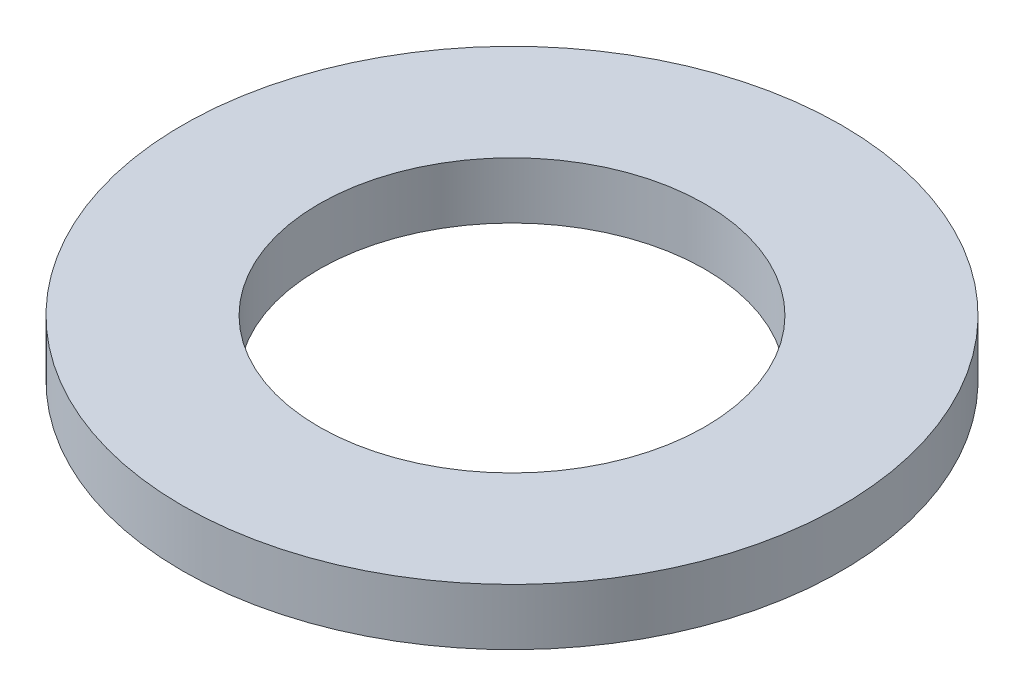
ISO-10303-21;
HEADER;
FILE_DESCRIPTION(('STEP AP214'),'2;1');
FILE_NAME('part.step','',(''),(''),'','','');
FILE_SCHEMA(('AUTOMOTIVE_DESIGN { 1 0 10303 214 1 1 1 1 }'));
ENDSEC;
DATA;
#1=APPLICATION_CONTEXT('core data for automotive mechanical design processes');
#2=APPLICATION_PROTOCOL_DEFINITION('international standard','automotive_design',2000,#1);
#3=PRODUCT_CONTEXT('',#1,'mechanical');
#4=PRODUCT('Part','Part','',(#3));
#5=PRODUCT_RELATED_PRODUCT_CATEGORY('part','',(#4));
#6=PRODUCT_DEFINITION_FORMATION('','',#4);
#7=PRODUCT_DEFINITION_CONTEXT('part definition',#1,'design');
#8=PRODUCT_DEFINITION('design','',#6,#7);
#9=PRODUCT_DEFINITION_SHAPE('','',#8);
#10=(LENGTH_UNIT() NAMED_UNIT(*) SI_UNIT(.MILLI.,.METRE.));
#11=(NAMED_UNIT(*) PLANE_ANGLE_UNIT() SI_UNIT($,.RADIAN.));
#12=(NAMED_UNIT(*) SI_UNIT($,.STERADIAN.) SOLID_ANGLE_UNIT());
#13=UNCERTAINTY_MEASURE_WITH_UNIT(LENGTH_MEASURE(1.E-05),#10,'distance_accuracy_value','');
#14=(GEOMETRIC_REPRESENTATION_CONTEXT(3) GLOBAL_UNCERTAINTY_ASSIGNED_CONTEXT((#13)) GLOBAL_UNIT_ASSIGNED_CONTEXT((#10,
#11,#12)) REPRESENTATION_CONTEXT('',''));
#15=CARTESIAN_POINT('',(0.,0.,0.));
#16=DIRECTION('',(0.,0.,1.));
#17=DIRECTION('',(1.,0.,0.));
#18=AXIS2_PLACEMENT_3D('',#15,#16,#17);
#19=CARTESIAN_POINT('',(0.,12.,0.));
#20=DIRECTION('',(0.,1.,0.));
#21=DIRECTION('',(0.,0.,1.));
#22=AXIS2_PLACEMENT_3D('',#19,#20,#21);
#23=PLANE('',#22);
#24=CARTESIAN_POINT('',(0.,12.,0.));
#25=DIRECTION('',(0.,1.,0.));
#26=DIRECTION('',(0.,0.,1.));
#27=AXIS2_PLACEMENT_3D('',#24,#25,#26);
#28=CIRCLE('',#27,70.);
#29=CARTESIAN_POINT('',(0.,12.,70.));
#30=VERTEX_POINT('',#29);
#31=EDGE_CURVE('E10',#30,#30,#28,.T.);
#32=ORIENTED_EDGE('',*,*,#31,.T.);
#33=EDGE_LOOP('',(#32));
#34=FACE_BOUND('',#33,.T.);
#35=CARTESIAN_POINT('',(0.,12.,0.));
#36=DIRECTION('',(0.,1.,0.));
#37=DIRECTION('',(0.,0.,1.));
#38=AXIS2_PLACEMENT_3D('',#35,#36,#37);
#39=CIRCLE('',#38,41.);
#40=CARTESIAN_POINT('',(0.,12.,41.));
#41=VERTEX_POINT('',#40);
#42=EDGE_CURVE('E39',#41,#41,#39,.T.);
#43=ORIENTED_EDGE('',*,*,#42,.F.);
#44=EDGE_LOOP('',(#43));
#45=FACE_BOUND('',#44,.T.);
#46=ADVANCED_FACE('F28',(#34,#45),#23,.T.);
#47=CARTESIAN_POINT('',(0.,0.,0.));
#48=DIRECTION('',(0.,1.,0.));
#49=DIRECTION('',(0.,0.,1.));
#50=AXIS2_PLACEMENT_3D('',#47,#48,#49);
#51=PLANE('',#50);
#52=CARTESIAN_POINT('',(0.,0.,0.));
#53=DIRECTION('',(0.,1.,0.));
#54=DIRECTION('',(0.,0.,1.));
#55=AXIS2_PLACEMENT_3D('',#52,#53,#54);
#56=CIRCLE('',#55,70.);
#57=CARTESIAN_POINT('',(0.,0.,70.));
#58=VERTEX_POINT('',#57);
#59=EDGE_CURVE('E35',#58,#58,#56,.T.);
#60=ORIENTED_EDGE('',*,*,#59,.F.);
#61=EDGE_LOOP('',(#60));
#62=FACE_BOUND('',#61,.T.);
#63=CARTESIAN_POINT('',(0.,0.,0.));
#64=DIRECTION('',(0.,1.,0.));
#65=DIRECTION('',(0.,0.,1.));
#66=AXIS2_PLACEMENT_3D('',#63,#64,#65);
#67=CIRCLE('',#66,41.);
#68=CARTESIAN_POINT('',(0.,0.,41.));
#69=VERTEX_POINT('',#68);
#70=EDGE_CURVE('E43',#69,#69,#67,.T.);
#71=ORIENTED_EDGE('',*,*,#70,.T.);
#72=EDGE_LOOP('',(#71));
#73=FACE_BOUND('',#72,.T.);
#74=ADVANCED_FACE('F49',(#62,#73),#51,.F.);
#75=CARTESIAN_POINT('',(0.,12.,0.));
#76=DIRECTION('',(0.,-1.,0.));
#77=DIRECTION('',(0.,0.,-1.));
#78=AXIS2_PLACEMENT_3D('',#75,#76,#77);
#79=CYLINDRICAL_SURFACE('',#78,70.);
#80=ORIENTED_EDGE('',*,*,#31,.F.);
#81=EDGE_LOOP('',(#80));
#82=FACE_BOUND('',#81,.T.);
#83=ORIENTED_EDGE('',*,*,#59,.T.);
#84=EDGE_LOOP('',(#83));
#85=FACE_BOUND('',#84,.T.);
#86=ADVANCED_FACE('F30',(#82,#85),#79,.T.);
#87=CARTESIAN_POINT('',(0.,12.,0.));
#88=DIRECTION('',(0.,-1.,0.));
#89=DIRECTION('',(0.,0.,-1.));
#90=AXIS2_PLACEMENT_3D('',#87,#88,#89);
#91=CYLINDRICAL_SURFACE('',#90,41.);
#92=ORIENTED_EDGE('',*,*,#42,.T.);
#93=EDGE_LOOP('',(#92));
#94=FACE_BOUND('',#93,.T.);
#95=ORIENTED_EDGE('',*,*,#70,.F.);
#96=EDGE_LOOP('',(#95));
#97=FACE_BOUND('',#96,.T.);
#98=ADVANCED_FACE('F51',(#94,#97),#91,.F.);
#99=CLOSED_SHELL('',(#46,#74,#86,#98));
#100=MANIFOLD_SOLID_BREP('B2',#99);
#101=ADVANCED_BREP_SHAPE_REPRESENTATION('',(#18,#100),#14);
#102=SHAPE_DEFINITION_REPRESENTATION(#9,#101);
ENDSEC;
END-ISO-10303-21;
